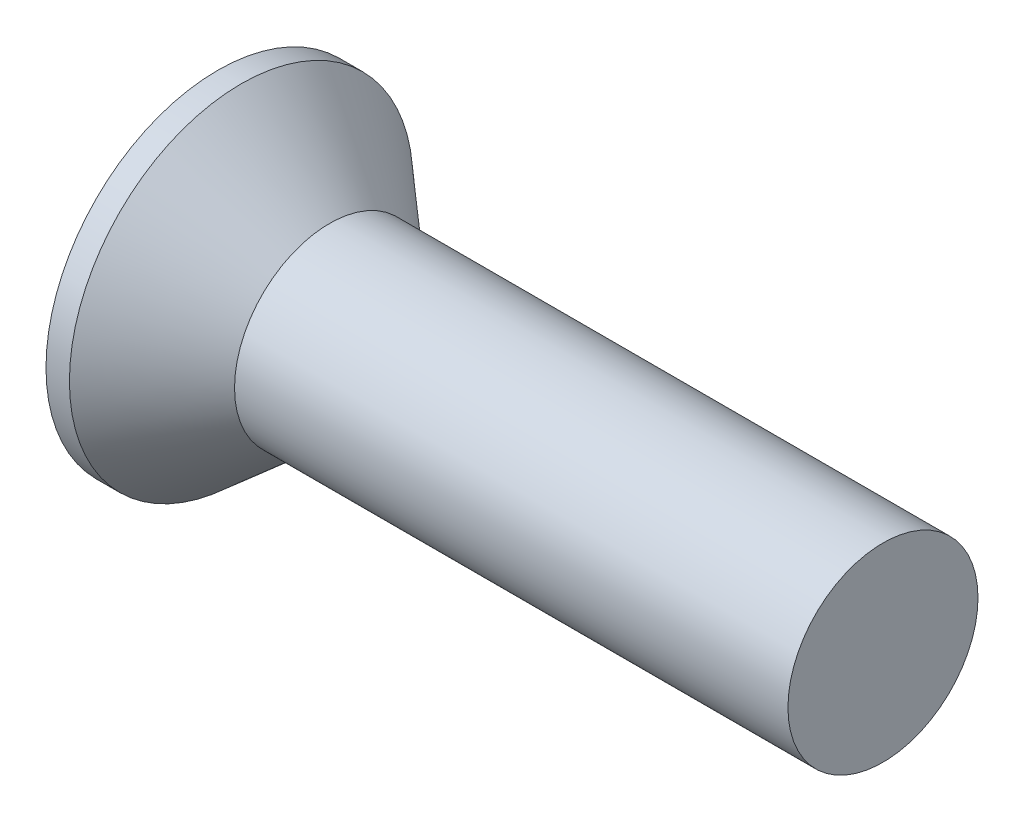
from build123d import *

# Parameters (mm, degrees)
CIRPATTERN1_COUNT = 2
CIRPATTERN1_ANGLE = 90


with BuildPart() as part:
    # BodySke → Base-Revolve (revolve)
    with BuildSketch(Plane.XY, mode=Mode.PRIVATE) as base_revolve_sk:
        Polygon((0, 0), (0, 5.7404), (0.782644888, 5.7404), (3.7338, 3.175), (22.225, 3.175), (22.225, 0), align=None)
    revolve(base_revolve_sk.sketch.rotate(Axis((-6.35, 0, 0), (1, 0, 0)), 90), axis=Axis((-6.35, 0, 0), (1, 0, 0)))

    # Sketch3 → Cross section 0
    with BuildSketch(Plane.ZY):
        with BuildLine():
            Line((-0.7747, 4.5085), (0.7747, 4.5085))
            Line((0.7747, 4.5085), (0.7747, -4.5085))
            Line((0.7747, -4.5085), (-0.7747, -4.5085))
            Line((-0.7747, -4.5085), (-0.7747, 4.5085))
        make_face()
    # Sketch4 → Cross section 1
    with BuildSketch(Plane.ZY.offset(-5.1816)):
        with BuildLine():
            Line((-0.38735, 0.38735), (0.38735, 0.38735))
            Line((0.38735, 0.38735), (0.38735, -0.38735))
            Line((0.38735, -0.38735), (-0.38735, -0.38735))
            Line((-0.38735, -0.38735), (-0.38735, 0.38735))
        make_face()
    cross = loft(mode=Mode.SUBTRACT)

    # CirPattern1: Cross ×2 about axis
    cirpattern1_axis = Axis((0, 0, 0), (1, 0, 0))
    for i in range(1, CIRPATTERN1_COUNT):
        add(cross.rotate(cirpattern1_axis, i * CIRPATTERN1_ANGLE / (CIRPATTERN1_COUNT - 1)), mode=Mode.SUBTRACT)


solid = part.part
